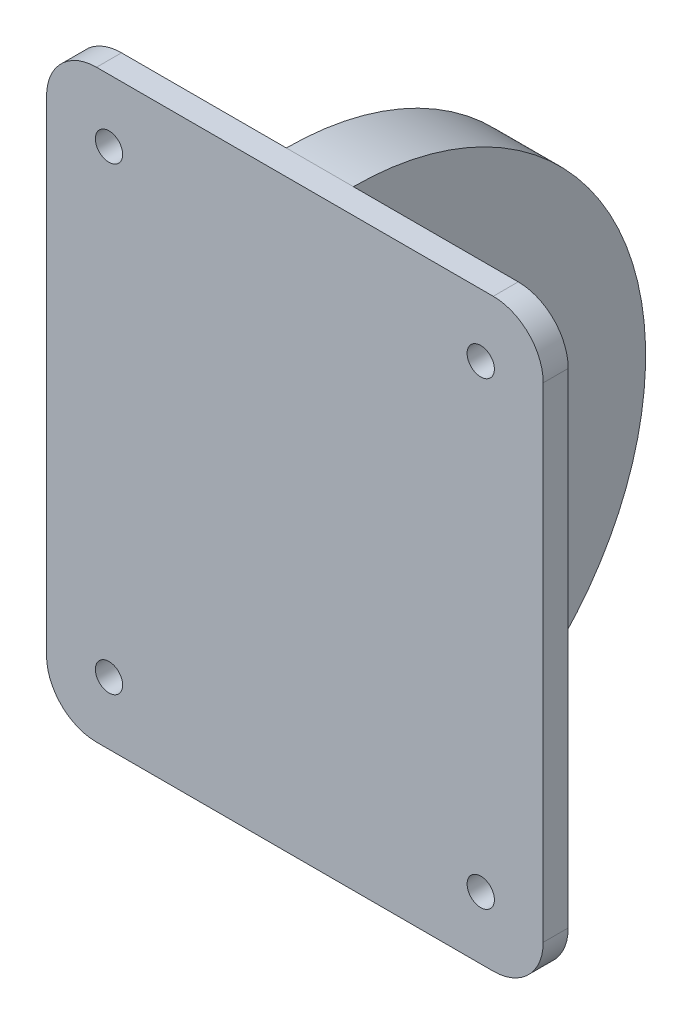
from build123d import *

# Parameters (mm, degrees)
SKETCH1_W           = 39.751736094
SKETCH1_H           = 46.779333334
BOSS_EXTRUDE1_DEPTH = 2
FILLET1_R           = 4
SKETCH2_R           = 1.0922
CUT_EXTRUDE1_DEPTH  = 2
BOSS_EXTRUDE2_DEPTH = 2.683333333
CUT_EXTRUDE2_REACH  = 42.038
SKETCH6_R           = 5


with BuildPart() as part:
    # Sketch1 → Boss-Extrude1 (new body)
    with BuildSketch(Plane.XY):
        Rectangle(SKETCH1_W, SKETCH1_H)
    extrude(amount=BOSS_EXTRUDE1_DEPTH)

    # Fillet1
    fillet1_edges = [part.edges().sort_by_distance(p)[0] for p in [
        (19.875868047, -23.389666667, 1),
        (-19.875868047, -23.389666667, 1),
        (-19.875868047, 23.389666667, 1),
        (19.875868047, 23.389666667, 1),
    ]]
    fillet(fillet1_edges, radius=FILLET1_R)

    # Sketch2 → Cut-Extrude1 (cut)
    with BuildSketch(Plane.XY.offset(2)):
        with Locations((-14.875868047, 18.389666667)):
            Circle(SKETCH2_R)
        with Locations((14.875868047, 18.389666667)):
            Circle(SKETCH2_R)
        with Locations((-14.875868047, -18.389666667)):
            Circle(SKETCH2_R)
        with Locations((14.875868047, -18.389666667)):
            Circle(SKETCH2_R)
    extrude(amount=-CUT_EXTRUDE1_DEPTH, mode=Mode.SUBTRACT)

    # Sketch5 → Boss-Extrude2 (add, symmetric)
    with BuildSketch(Plane(origin=(0, 0, 0), x_dir=(0, 0, -1), z_dir=(1, 0, 0))):
        with BuildLine():
            Line((0, 23.389666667), (0, -23.389666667))
            ThreePointArc((0, -23.389666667), (23.389666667, 0), (0, 23.389666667))
        make_face()
    extrude(amount=BOSS_EXTRUDE2_DEPTH, both=True)

    # Sketch6 → Cut-Extrude2 (cut, up to next)
    with BuildSketch(Plane(origin=(2.683333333, 0, 0), x_dir=(0, 0, -1), z_dir=(1, 0, 0)), mode=Mode.PRIVATE) as cut_extrude2_sk1:
        with Locations((10.61, 0)):
            Circle(SKETCH6_R)
    cut_extrude2_tool1 = extrude(cut_extrude2_sk1.sketch, amount=-CUT_EXTRUDE2_REACH, mode=Mode.PRIVATE) & part.part
    add(cut_extrude2_tool1.solids().sort_by_distance((2.683333, 0, -10.61))[0], mode=Mode.SUBTRACT)


solid = part.part
